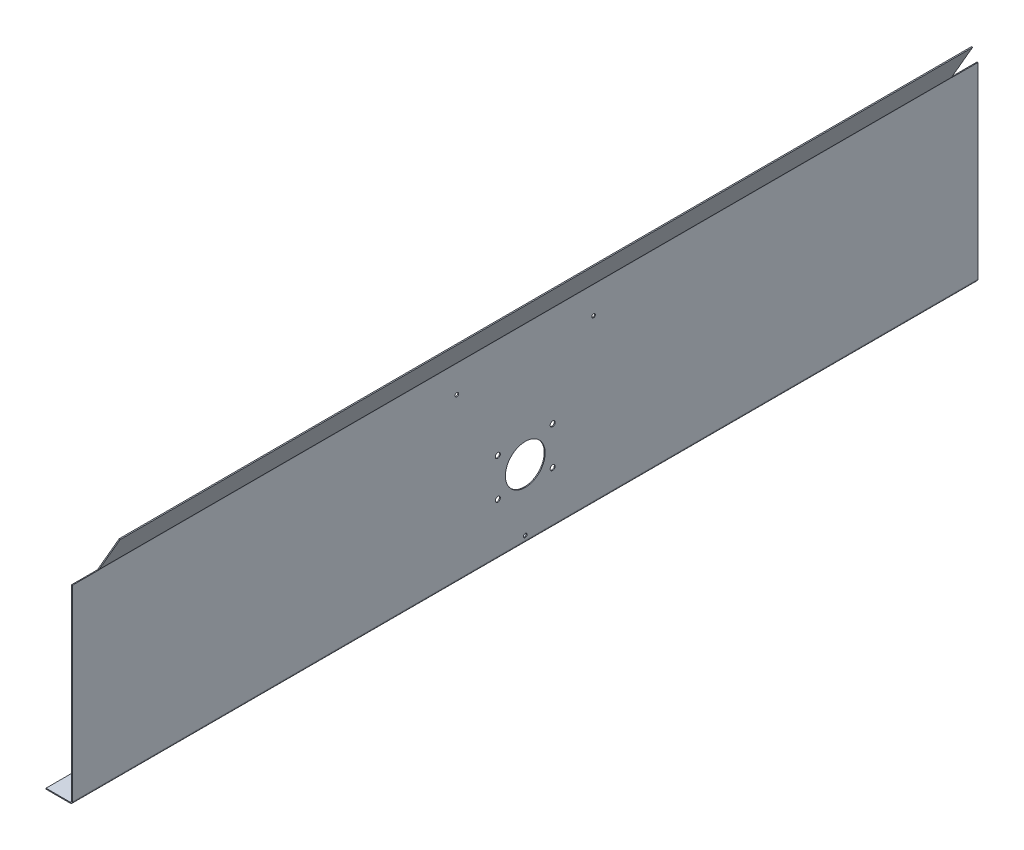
from build123d import *

# Parameters (mm, degrees)
EXTRUSION1_DEPTH        = 990
ESQUISSE2_R             = 43.5
ESQUISSE2_R_2           = 5.5
ESQUISSE2_R_3           = 4
ENL_V_MAT_EXTRU_1_DEPTH = 1110.121002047
ESQUISSE3_W             = 58
ESQUISSE3_H             = 81.344210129
ENL_V_MAT_EXTRU_2_DEPTH = 1110.018213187


with BuildPart() as part:
    # Esquisse1 → Extrusion1 (new, symmetric)
    with BuildSketch(Plane.XY):
        with BuildLine():
            Line((0, 0), (53, 0))
            ThreePointArc((53, 0), (56.535533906, 1.464466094), (58, 5))
            Line((58, 5), (58, 415.330127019))
            ThreePointArc((58, 415.330127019), (58.085185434, 415.977174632), (58.334936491, 416.580127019))
            Line((58.334936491, 416.580127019), (104, 495.674337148))
            Line((104, 495.674337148), (102.267949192, 496.674337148))
            Line((102.267949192, 496.674337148), (56.602885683, 417.580127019))
            ThreePointArc((56.602885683, 417.580127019), (56.153333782, 416.494812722), (56, 415.330127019))
            Line((56, 415.330127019), (56, 5))
            ThreePointArc((56, 5), (55.121320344, 2.878679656), (53, 2))
            Line((53, 2), (0, 2))
            Line((0, 2), (0, 0))
        make_face()
    extrude(amount=EXTRUSION1_DEPTH, both=True)

    # Esquisse2 → Enl_v. mat.-Extru.1 (cut, through all)
    with BuildSketch(Plane(origin=(58, 0, 0), x_dir=(0, 0, -1), z_dir=(1, 0, 0))):
        with Locations(Location((0, 149, 0), (0, 0, 90))):
            Circle(ESQUISSE2_R)
        with Locations(Location((-60, 113, 0), (0, 0, 90))):
            Circle(ESQUISSE2_R_2)
        with Locations(Location((-60, 196, 0), (0, 0, 90))):
            Circle(ESQUISSE2_R_2)
        with Locations(Location((60, 196, 0), (0, 0, 90))):
            Circle(ESQUISSE2_R_2)
        with Locations(Location((60, 113, 0), (0, 0, 90))):
            Circle(ESQUISSE2_R_2)
        with Locations(Location((0, 14.5, 0), (0, 0, 90))):
            Circle(ESQUISSE2_R_3)
        with Locations(Location((-149.5, 356, 0), (0, 0, 90))):
            Circle(ESQUISSE2_R_3)
        with Locations(Location((149.5, 356, 0), (0, 0, 90))):
            Circle(ESQUISSE2_R_3)
    extrude(amount=-ENL_V_MAT_EXTRU_1_DEPTH, mode=Mode.SUBTRACT)

    # Esquisse3 → Enl_v. mat.-Extru.2 (cut, through all)
    with BuildSketch(Plane.ZY.offset(-56)):
        with Locations((961, 456.002232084)):
            Rectangle(ESQUISSE3_W, ESQUISSE3_H)
        with Locations((-961, 456.002232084)):
            Rectangle(ESQUISSE3_W, ESQUISSE3_H)
    extrude(amount=-ENL_V_MAT_EXTRU_2_DEPTH, mode=Mode.SUBTRACT)


solid = part.part
